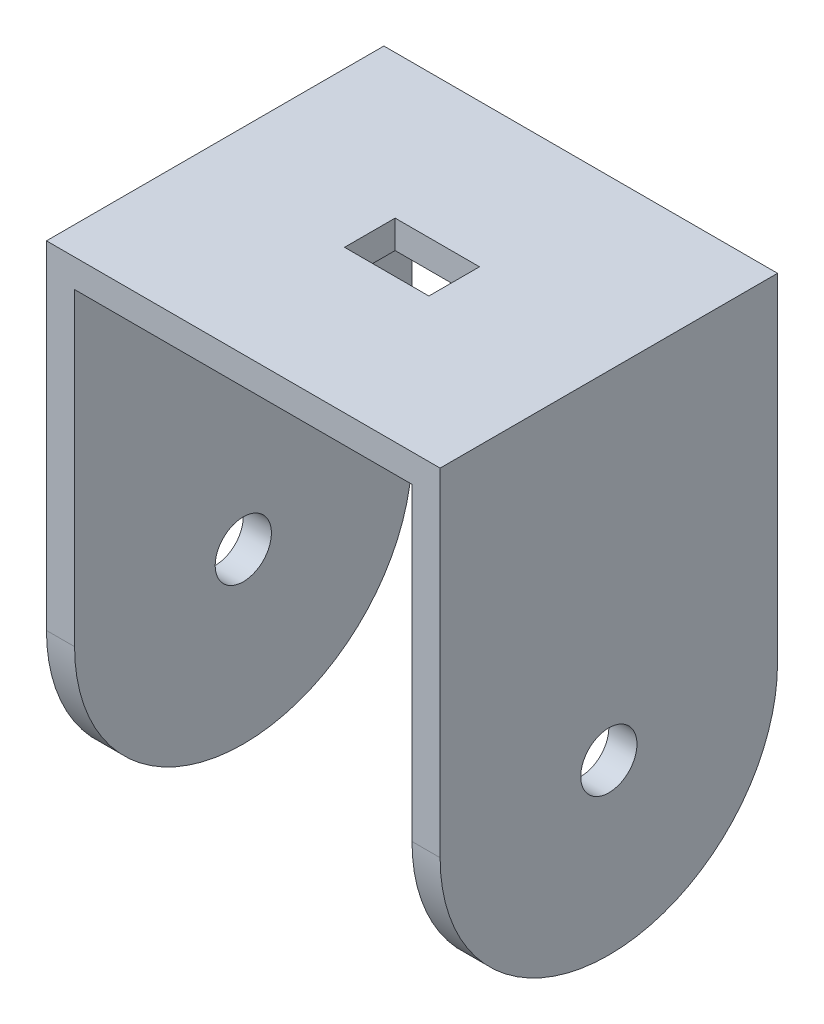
from build123d import *

# Parameters (mm, degrees)
SKETCH2_W           = 70
SKETCH2_H           = 60
BOSS_EXTRUDE1_DEPTH = 5
BOSS_EXTRUDE2_DEPTH = 5
SKETCH4_R           = 5
CUT_EXTRUDE1_DEPTH  = 118.898261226
SKETCH5_W           = 15
SKETCH5_H           = 9
CUT_EXTRUDE2_DEPTH  = 10


with BuildPart() as part:
    # Sketch2 → Boss-Extrude1 (new body)
    with BuildSketch(Plane(origin=(0, 0, 0), x_dir=(1, 0, 0), z_dir=(0, 1, 0))):
        Rectangle(SKETCH2_W, SKETCH2_H)
    extrude(amount=-BOSS_EXTRUDE1_DEPTH)

    # Sketch3 → Boss-Extrude2 (add)
    with BuildSketch(Plane(origin=(35, 0, 0), x_dir=(0, 0, -1), z_dir=(1, 0, 0))):
        with BuildLine():
            Line((-30, 0), (-30, -60))
            ThreePointArc((-30, -60), (0, -90), (30, -60))
            Line((30, -60), (30, 0))
            Line((30, 0), (-30, 0))
        make_face()
    boss_extrude2 = extrude(amount=-BOSS_EXTRUDE2_DEPTH)

    # Mirror1: Boss-Extrude2 across plane
    add(boss_extrude2.mirror(Plane(origin=(0, 0, 0), x_dir=(0, 0, 1), z_dir=(1, 0, 0))))

    # Sketch4 → Cut-Extrude1 (cut, through all)
    with BuildSketch(Plane(origin=(35, 0, 0), x_dir=(0, 0, -1), z_dir=(1, 0, 0))):
        with Locations((0, -60)):
            Circle(SKETCH4_R)
    extrude(amount=-CUT_EXTRUDE1_DEPTH, mode=Mode.SUBTRACT)

    # Sketch5 → Cut-Extrude2 (cut)
    with BuildSketch(Plane(origin=(0, 0, 0), x_dir=(1, 0, 0), z_dir=(0, 1, 0))):
        Rectangle(SKETCH5_W, SKETCH5_H)
    extrude(amount=-CUT_EXTRUDE2_DEPTH, mode=Mode.SUBTRACT)


solid = part.part
